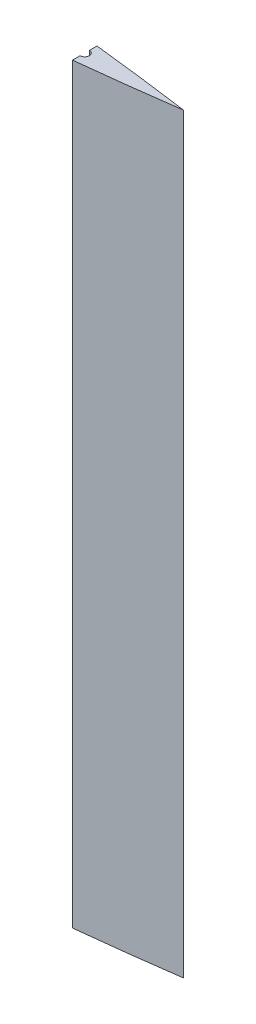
ISO-10303-21;
HEADER;
FILE_DESCRIPTION(('STEP AP214'),'2;1');
FILE_NAME('part.step','',(''),(''),'','','');
FILE_SCHEMA(('AUTOMOTIVE_DESIGN { 1 0 10303 214 1 1 1 1 }'));
ENDSEC;
DATA;
#1=APPLICATION_CONTEXT('core data for automotive mechanical design processes');
#2=APPLICATION_PROTOCOL_DEFINITION('international standard','automotive_design',2000,#1);
#3=PRODUCT_CONTEXT('',#1,'mechanical');
#4=PRODUCT('Part','Part','',(#3));
#5=PRODUCT_RELATED_PRODUCT_CATEGORY('part','',(#4));
#6=PRODUCT_DEFINITION_FORMATION('','',#4);
#7=PRODUCT_DEFINITION_CONTEXT('part definition',#1,'design');
#8=PRODUCT_DEFINITION('design','',#6,#7);
#9=PRODUCT_DEFINITION_SHAPE('','',#8);
#10=(LENGTH_UNIT() NAMED_UNIT(*) SI_UNIT(.MILLI.,.METRE.));
#11=(NAMED_UNIT(*) PLANE_ANGLE_UNIT() SI_UNIT($,.RADIAN.));
#12=(NAMED_UNIT(*) SI_UNIT($,.STERADIAN.) SOLID_ANGLE_UNIT());
#13=UNCERTAINTY_MEASURE_WITH_UNIT(LENGTH_MEASURE(1.E-05),#10,'distance_accuracy_value','');
#14=(GEOMETRIC_REPRESENTATION_CONTEXT(3) GLOBAL_UNCERTAINTY_ASSIGNED_CONTEXT((#13)) GLOBAL_UNIT_ASSIGNED_CONTEXT((#10,
#11,#12)) REPRESENTATION_CONTEXT('',''));
#15=CARTESIAN_POINT('',(0.,0.,0.));
#16=DIRECTION('',(0.,0.,1.));
#17=DIRECTION('',(1.,0.,0.));
#18=AXIS2_PLACEMENT_3D('',#15,#16,#17);
#19=CARTESIAN_POINT('',(-73.4484714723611,0.,-0.114675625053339));
#20=DIRECTION('',(0.,1.,0.));
#21=DIRECTION('',(0.,0.,1.));
#22=AXIS2_PLACEMENT_3D('',#19,#20,#21);
#23=PLANE('',#22);
#24=CARTESIAN_POINT('',(35.7790397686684,0.,-0.131246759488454));
#25=DIRECTION('',(0.,1.,0.));
#26=DIRECTION('',(0.,0.,1.));
#27=AXIS2_PLACEMENT_3D('',#24,#25,#26);
#28=CIRCLE('',#27,1.5);
#29=CARTESIAN_POINT('',(35.7790397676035,0.,1.36875324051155));
#30=VERTEX_POINT('',#29);
#31=CARTESIAN_POINT('',(35.7790397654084,0.,-1.63124675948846));
#32=VERTEX_POINT('',#31);
#33=EDGE_CURVE('E11',#30,#32,#28,.T.);
#34=ORIENTED_EDGE('',*,*,#33,.T.);
#35=DIRECTION('',(0.,0.,1.));
#36=VECTOR('',#35,1.);
#37=CARTESIAN_POINT('',(35.7790397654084,0.,-0.114675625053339));
#38=LINE('',#37,#36);
#39=CARTESIAN_POINT('',(35.7790397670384,0.,-4.09956647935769));
#40=VERTEX_POINT('',#39);
#41=EDGE_CURVE('E52',#32,#40,#38,.F.);
#42=ORIENTED_EDGE('',*,*,#41,.T.);
#43=CARTESIAN_POINT('',(67.7790397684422,0.,-0.131246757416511));
#44=CARTESIAN_POINT('',(65.0370068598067,0.,-0.509034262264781));
#45=CARTESIAN_POINT('',(59.9652619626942,0.,-1.21325090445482));
#46=CARTESIAN_POINT('',(52.5544718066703,0.,-2.15837467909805));
#47=CARTESIAN_POINT('',(45.5543935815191,0.,-3.00647835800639));
#48=CARTESIAN_POINT('',(39.9620126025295,0.,-3.64321653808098));
#49=CARTESIAN_POINT('',(36.7033242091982,0.,-3.99965601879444));
#50=CARTESIAN_POINT('',(35.7790397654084,0.,-4.09956647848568));
#51=B_SPLINE_CURVE_WITH_KNOTS('',3,(#43,#44,#45,#46,#47,#48,#49,#50),.UNSPECIFIED.,.F.,.F.,(4,1,
1,1,1,4),(-0.00432084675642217,0.0246342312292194,0.0492428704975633,0.0738297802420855,
0.0983967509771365,0.108121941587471),.UNSPECIFIED.);
#52=CARTESIAN_POINT('',(67.7790397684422,0.,-0.131246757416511));
#53=VERTEX_POINT('',#52);
#54=EDGE_CURVE('E201',#53,#40,#51,.T.);
#55=ORIENTED_EDGE('',*,*,#54,.F.);
#56=DIRECTION('',(0.990641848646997,0.,0.136487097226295));
#57=VECTOR('',#56,1.);
#58=CARTESIAN_POINT('',(1.2803831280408,0.,-9.29319426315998));
#59=LINE('',#58,#57);
#60=CARTESIAN_POINT('',(67.8308938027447,0.,-0.124102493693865));
#61=VERTEX_POINT('',#60);
#62=EDGE_CURVE('E218',#53,#61,#59,.T.);
#63=ORIENTED_EDGE('',*,*,#62,.T.);
#64=DIRECTION('',(0.990642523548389,0.,-0.136482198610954));
#65=VECTOR('',#64,1.);
#66=CARTESIAN_POINT('',(1.24673326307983,0.,9.04928993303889));
#67=LINE('',#66,#65);
#68=CARTESIAN_POINT('',(67.7978926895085,0.,-0.119555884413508));
#69=VERTEX_POINT('',#68);
#70=EDGE_CURVE('E166',#69,#61,#67,.T.);
#71=ORIENTED_EDGE('',*,*,#70,.F.);
#72=CARTESIAN_POINT('',(35.7790397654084,0.,3.85136127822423));
#73=CARTESIAN_POINT('',(36.7033242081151,0.,3.75145081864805));
#74=CARTESIAN_POINT('',(39.9620126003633,0.,3.39501133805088));
#75=CARTESIAN_POINT('',(45.5543935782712,0.,2.75827315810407));
#76=CARTESIAN_POINT('',(52.5544718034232,0.,1.91016947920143));
#77=CARTESIAN_POINT('',(59.9715547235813,0.,0.964243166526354));
#78=CARTESIAN_POINT('',(65.0495736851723,0.,0.259084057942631));
#79=CARTESIAN_POINT('',(67.7978926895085,0.,-0.11955588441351));
#80=B_SPLINE_CURVE_WITH_KNOTS('',3,(#72,#73,#74,#75,#76,#77,#78,#79),.UNSPECIFIED.,.F.,.F.,(4,1,
1,1,1,4),(0.891878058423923,0.901603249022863,0.926170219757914,0.950757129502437,
0.975365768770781,1.00438720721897),.UNSPECIFIED.);
#81=CARTESIAN_POINT('',(35.7790397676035,0.,3.85136127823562));
#82=VERTEX_POINT('',#81);
#83=EDGE_CURVE('E98',#82,#69,#80,.T.);
#84=ORIENTED_EDGE('',*,*,#83,.F.);
#85=DIRECTION('',(0.,0.,1.));
#86=VECTOR('',#85,1.);
#87=CARTESIAN_POINT('',(35.7790397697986,0.,-0.114675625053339));
#88=LINE('',#87,#86);
#89=EDGE_CURVE('E68',#82,#30,#88,.F.);
#90=ORIENTED_EDGE('',*,*,#89,.T.);
#91=EDGE_LOOP('',(#34,#42,#55,#63,#71,#84,#90));
#92=FACE_BOUND('',#91,.T.);
#93=ADVANCED_FACE('F49',(#92),#23,.F.);
#94=CARTESIAN_POINT('',(35.7790397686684,0.,-0.131246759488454));
#95=DIRECTION('',(0.,1.,0.));
#96=DIRECTION('',(0.,0.,1.));
#97=AXIS2_PLACEMENT_3D('',#94,#95,#96);
#98=CYLINDRICAL_SURFACE('',#97,1.5);
#99=DIRECTION('',(0.,-1.,0.));
#100=VECTOR('',#99,1.);
#101=CARTESIAN_POINT('',(35.7790397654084,244.,-1.63124675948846));
#102=LINE('',#101,#100);
#103=CARTESIAN_POINT('',(35.7790397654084,244.,-1.63124675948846));
#104=VERTEX_POINT('',#103);
#105=EDGE_CURVE('E83',#104,#32,#102,.T.);
#106=ORIENTED_EDGE('',*,*,#105,.T.);
#107=ORIENTED_EDGE('',*,*,#33,.F.);
#108=DIRECTION('',(0.,-1.,0.));
#109=VECTOR('',#108,1.);
#110=CARTESIAN_POINT('',(35.7790397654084,244.,1.36875324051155));
#111=LINE('',#110,#109);
#112=CARTESIAN_POINT('',(35.7790397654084,244.,1.36875324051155));
#113=VERTEX_POINT('',#112);
#114=EDGE_CURVE('E196',#113,#30,#111,.T.);
#115=ORIENTED_EDGE('',*,*,#114,.F.);
#116=CARTESIAN_POINT('',(35.7790397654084,244.,-0.131246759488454));
#117=DIRECTION('',(0.,1.,0.));
#118=DIRECTION('',(0.,0.,1.));
#119=AXIS2_PLACEMENT_3D('',#116,#117,#118);
#120=CIRCLE('',#119,1.5);
#121=EDGE_CURVE('E197',#113,#104,#120,.T.);
#122=ORIENTED_EDGE('',*,*,#121,.T.);
#123=EDGE_LOOP('',(#106,#107,#115,#122));
#124=FACE_BOUND('',#123,.T.);
#125=ADVANCED_FACE('F187',(#124),#98,.F.);
#126=CARTESIAN_POINT('',(35.7790397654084,244.,0.));
#127=DIRECTION('',(1.,0.,0.));
#128=DIRECTION('',(0.,0.,-1.));
#129=AXIS2_PLACEMENT_3D('',#126,#127,#128);
#130=PLANE('',#129);
#131=ORIENTED_EDGE('',*,*,#114,.T.);
#132=ORIENTED_EDGE('',*,*,#89,.F.);
#133=DIRECTION('',(0.,-1.,0.));
#134=VECTOR('',#133,1.);
#135=CARTESIAN_POINT('',(35.7790397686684,1.5875,3.85136127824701));
#136=LINE('',#135,#134);
#137=CARTESIAN_POINT('',(35.7790397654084,244.,3.85136127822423));
#138=VERTEX_POINT('',#137);
#139=EDGE_CURVE('E59',#82,#138,#136,.F.);
#140=ORIENTED_EDGE('',*,*,#139,.T.);
#141=DIRECTION('',(0.,0.,1.));
#142=VECTOR('',#141,1.);
#143=CARTESIAN_POINT('',(35.7790397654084,244.,0.));
#144=LINE('',#143,#142);
#145=EDGE_CURVE('E137',#113,#138,#144,.T.);
#146=ORIENTED_EDGE('',*,*,#145,.F.);
#147=EDGE_LOOP('',(#131,#132,#140,#146));
#148=FACE_BOUND('',#147,.T.);
#149=ADVANCED_FACE('F185',(#148),#130,.F.);
#150=CARTESIAN_POINT('',(35.7790397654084,244.,3.85136127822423));
#151=CARTESIAN_POINT('',(36.7033242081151,244.,3.75145081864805));
#152=CARTESIAN_POINT('',(39.9620126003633,244.,3.39501133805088));
#153=CARTESIAN_POINT('',(45.5543935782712,244.,2.75827315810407));
#154=CARTESIAN_POINT('',(52.5544718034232,244.,1.91016947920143));
#155=CARTESIAN_POINT('',(59.9715547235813,244.,0.964243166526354));
#156=CARTESIAN_POINT('',(65.0495736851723,244.,0.259084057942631));
#157=CARTESIAN_POINT('',(67.7978926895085,244.,-0.11955588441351));
#158=B_SPLINE_CURVE_WITH_KNOTS('',3,(#150,#151,#152,#153,#154,#155,#156,#157),.UNSPECIFIED.,.F.,
.F.,(4,1,1,1,1,4),(0.891878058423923,0.901603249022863,0.926170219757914,0.950757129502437,
0.975365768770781,1.00438720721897),.UNSPECIFIED.);
#159=DIRECTION('',(0.,-1.,0.));
#160=VECTOR('',#159,1.);
#161=SURFACE_OF_LINEAR_EXTRUSION('',#158,#160);
#162=ORIENTED_EDGE('',*,*,#83,.T.);
#163=DIRECTION('',(0.,-1.,0.));
#164=VECTOR('',#163,1.);
#165=CARTESIAN_POINT('',(67.7978926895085,244.,-0.119555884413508));
#166=LINE('',#165,#164);
#167=CARTESIAN_POINT('',(67.7978926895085,244.,-0.119555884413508));
#168=VERTEX_POINT('',#167);
#169=EDGE_CURVE('E140',#168,#69,#166,.T.);
#170=ORIENTED_EDGE('',*,*,#169,.F.);
#171=EDGE_CURVE('E133',#138,#168,#158,.T.);
#172=ORIENTED_EDGE('',*,*,#171,.F.);
#173=ORIENTED_EDGE('',*,*,#139,.F.);
#174=EDGE_LOOP('',(#162,#170,#172,#173));
#175=FACE_BOUND('',#174,.T.);
#176=ADVANCED_FACE('F141',(#175),#161,.F.);
#177=CARTESIAN_POINT('',(1.24673326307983,244.,9.04928993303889));
#178=DIRECTION('',(-0.136482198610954,0.,-0.990642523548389));
#179=DIRECTION('',(-0.990642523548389,0.,0.136482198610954));
#180=AXIS2_PLACEMENT_3D('',#177,#178,#179);
#181=PLANE('',#180);
#182=ORIENTED_EDGE('',*,*,#70,.T.);
#183=DIRECTION('',(0.,-1.,0.));
#184=VECTOR('',#183,1.);
#185=CARTESIAN_POINT('',(67.8308938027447,244.,-0.124102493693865));
#186=LINE('',#185,#184);
#187=CARTESIAN_POINT('',(67.8308938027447,244.,-0.124102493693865));
#188=VERTEX_POINT('',#187);
#189=EDGE_CURVE('E146',#188,#61,#186,.T.);
#190=ORIENTED_EDGE('',*,*,#189,.F.);
#191=DIRECTION('',(0.990642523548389,0.,-0.136482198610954));
#192=VECTOR('',#191,1.);
#193=CARTESIAN_POINT('',(1.24673326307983,244.,9.04928993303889));
#194=LINE('',#193,#192);
#195=EDGE_CURVE('E128',#168,#188,#194,.T.);
#196=ORIENTED_EDGE('',*,*,#195,.F.);
#197=ORIENTED_EDGE('',*,*,#169,.T.);
#198=EDGE_LOOP('',(#182,#190,#196,#197));
#199=FACE_BOUND('',#198,.T.);
#200=ADVANCED_FACE('F148',(#199),#181,.F.);
#201=CARTESIAN_POINT('',(1.2803831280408,244.,-9.29319426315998));
#202=DIRECTION('',(0.136487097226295,0.,-0.990641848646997));
#203=DIRECTION('',(-0.990641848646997,0.,-0.136487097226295));
#204=AXIS2_PLACEMENT_3D('',#201,#202,#203);
#205=PLANE('',#204);
#206=ORIENTED_EDGE('',*,*,#62,.F.);
#207=DIRECTION('',(0.,-1.,0.));
#208=VECTOR('',#207,1.);
#209=CARTESIAN_POINT('',(67.7790397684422,244.,-0.131246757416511));
#210=LINE('',#209,#208);
#211=CARTESIAN_POINT('',(67.7790397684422,244.,-0.131246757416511));
#212=VERTEX_POINT('',#211);
#213=EDGE_CURVE('E122',#212,#53,#210,.T.);
#214=ORIENTED_EDGE('',*,*,#213,.F.);
#215=DIRECTION('',(0.990641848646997,0.,0.136487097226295));
#216=VECTOR('',#215,1.);
#217=CARTESIAN_POINT('',(1.2803831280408,244.,-9.29319426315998));
#218=LINE('',#217,#216);
#219=EDGE_CURVE('E150',#212,#188,#218,.T.);
#220=ORIENTED_EDGE('',*,*,#219,.T.);
#221=ORIENTED_EDGE('',*,*,#189,.T.);
#222=EDGE_LOOP('',(#206,#214,#220,#221));
#223=FACE_BOUND('',#222,.T.);
#224=ADVANCED_FACE('F177',(#223),#205,.T.);
#225=CARTESIAN_POINT('',(67.7790397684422,244.,-0.131246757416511));
#226=CARTESIAN_POINT('',(65.0370068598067,244.,-0.509034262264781));
#227=CARTESIAN_POINT('',(59.9652619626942,244.,-1.21325090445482));
#228=CARTESIAN_POINT('',(52.5544718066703,244.,-2.15837467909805));
#229=CARTESIAN_POINT('',(45.5543935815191,244.,-3.00647835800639));
#230=CARTESIAN_POINT('',(39.9620126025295,244.,-3.64321653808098));
#231=CARTESIAN_POINT('',(36.7033242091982,244.,-3.99965601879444));
#232=CARTESIAN_POINT('',(35.7790397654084,244.,-4.09956647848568));
#233=B_SPLINE_CURVE_WITH_KNOTS('',3,(#225,#226,#227,#228,#229,#230,#231,#232),.UNSPECIFIED.,.F.,
.F.,(4,1,1,1,1,4),(-0.00432084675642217,0.0246342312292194,0.0492428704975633,
0.0738297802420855,0.0983967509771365,0.108121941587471),.UNSPECIFIED.);
#234=DIRECTION('',(0.,-1.,0.));
#235=VECTOR('',#234,1.);
#236=SURFACE_OF_LINEAR_EXTRUSION('',#233,#235);
#237=ORIENTED_EDGE('',*,*,#54,.T.);
#238=DIRECTION('',(0.,-1.,0.));
#239=VECTOR('',#238,1.);
#240=CARTESIAN_POINT('',(35.7790397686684,1.5875,-4.09956648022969));
#241=LINE('',#240,#239);
#242=CARTESIAN_POINT('',(35.7790397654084,244.,-4.09956647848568));
#243=VERTEX_POINT('',#242);
#244=EDGE_CURVE('E90',#40,#243,#241,.F.);
#245=ORIENTED_EDGE('',*,*,#244,.T.);
#246=EDGE_CURVE('E154',#212,#243,#233,.T.);
#247=ORIENTED_EDGE('',*,*,#246,.F.);
#248=ORIENTED_EDGE('',*,*,#213,.T.);
#249=EDGE_LOOP('',(#237,#245,#247,#248));
#250=FACE_BOUND('',#249,.T.);
#251=ADVANCED_FACE('F172',(#250),#236,.F.);
#252=CARTESIAN_POINT('',(35.7790397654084,244.,0.));
#253=DIRECTION('',(1.,0.,0.));
#254=DIRECTION('',(0.,0.,-1.));
#255=AXIS2_PLACEMENT_3D('',#252,#253,#254);
#256=PLANE('',#255);
#257=DIRECTION('',(0.,0.,1.));
#258=VECTOR('',#257,1.);
#259=CARTESIAN_POINT('',(35.7790397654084,244.,0.));
#260=LINE('',#259,#258);
#261=EDGE_CURVE('E165',#243,#104,#260,.T.);
#262=ORIENTED_EDGE('',*,*,#261,.F.);
#263=ORIENTED_EDGE('',*,*,#244,.F.);
#264=ORIENTED_EDGE('',*,*,#41,.F.);
#265=ORIENTED_EDGE('',*,*,#105,.F.);
#266=EDGE_LOOP('',(#262,#263,#264,#265));
#267=FACE_BOUND('',#266,.T.);
#268=ADVANCED_FACE('F176',(#267),#256,.F.);
#269=CARTESIAN_POINT('',(0.,244.,0.));
#270=DIRECTION('',(0.,1.,0.));
#271=DIRECTION('',(0.,0.,1.));
#272=AXIS2_PLACEMENT_3D('',#269,#270,#271);
#273=PLANE('',#272);
#274=ORIENTED_EDGE('',*,*,#145,.T.);
#275=ORIENTED_EDGE('',*,*,#171,.T.);
#276=ORIENTED_EDGE('',*,*,#195,.T.);
#277=ORIENTED_EDGE('',*,*,#219,.F.);
#278=ORIENTED_EDGE('',*,*,#246,.T.);
#279=ORIENTED_EDGE('',*,*,#261,.T.);
#280=ORIENTED_EDGE('',*,*,#121,.F.);
#281=EDGE_LOOP('',(#274,#275,#276,#277,#278,#279,#280));
#282=FACE_BOUND('',#281,.T.);
#283=ADVANCED_FACE('F134',(#282),#273,.T.);
#284=CLOSED_SHELL('',(#93,#125,#149,#176,#200,#224,#251,#268,#283));
#285=MANIFOLD_SOLID_BREP('B2',#284);
#286=ADVANCED_BREP_SHAPE_REPRESENTATION('',(#18,#285),#14);
#287=SHAPE_DEFINITION_REPRESENTATION(#9,#286);
ENDSEC;
END-ISO-10303-21;
